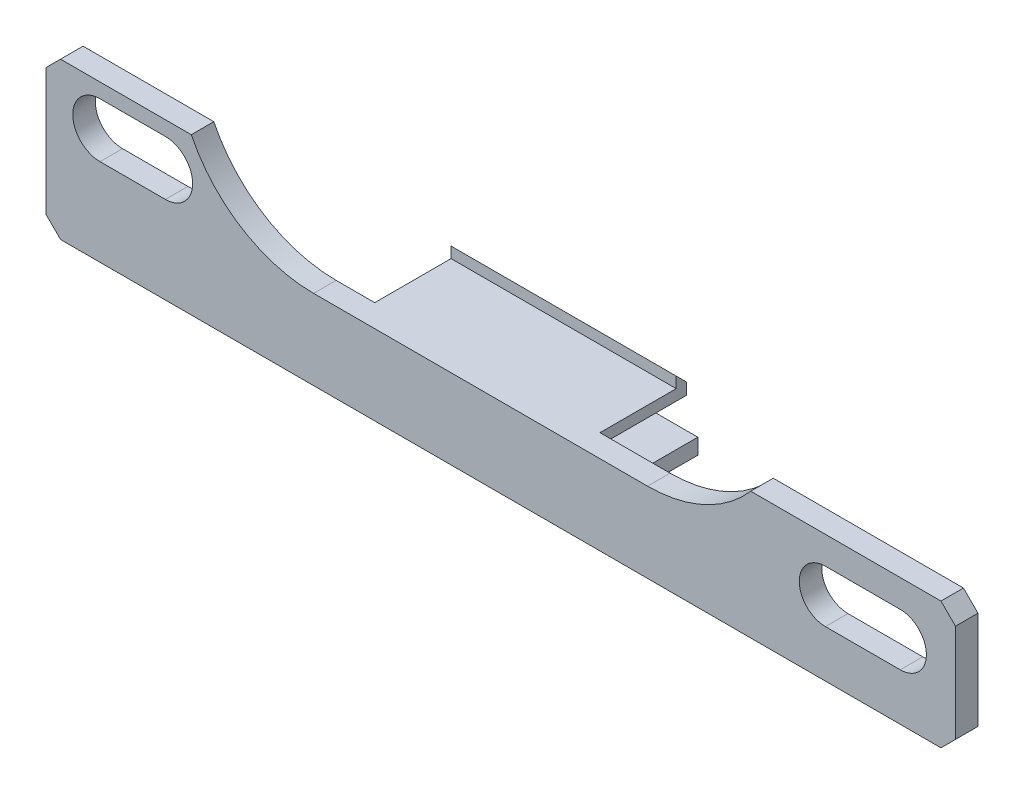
from build123d import *

# Parameters (mm, degrees)
BOSS_EXTRUDE1_DEPTH = 1.5748
SKETCH2_W           = 17.272
SKETCH2_H           = 1.0922
BOSS_EXTRUDE2_DEPTH = 7.62
BOSS_EXTRUDE3_START = -21.4122
BOSS_EXTRUDE3_DEPTH = 15.748
CHAMFER1_SIZE       = 1.016


with BuildPart() as part:
    # Sketch1 → Boss-Extrude1 (new body)
    with BuildSketch(Plane.XY):
        with BuildLine():
            Line((0, 0), (0, 10.922))
            Line((0, 10.922), (10.16, 10.922))
            ThreePointArc((10.16, 10.922), (13.673272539, 7.030769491), (18.713428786, 5.588))
            Line((18.713428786, 5.588), (42.06490466, 5.588))
            ThreePointArc((42.06490466, 5.588), (46.030478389, 6.452754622), (49.276, 8.89))
            Line((49.276, 8.89), (63.595327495, 8.89))
            Line((63.595327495, 8.89), (63.595327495, 0))
            Line((63.595327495, 0), (0, 0))
        make_face()
        with BuildLine():
            Line((3.776028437, 9.906), (8.348028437, 9.906))
            ThreePointArc((8.348028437, 9.906), (10.253028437, 8.001), (8.348028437, 6.096))
            Line((8.348028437, 6.096), (3.776028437, 6.096))
            ThreePointArc((3.776028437, 6.096), (1.871028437, 8.001), (3.776028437, 9.906))
        make_face(mode=Mode.SUBTRACT)
        with BuildLine():
            Line((54.499828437, 6.9596), (59.732228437, 6.9596))
            ThreePointArc((59.732228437, 6.9596), (61.561028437, 5.1308), (59.732228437, 3.302))
            Line((59.732228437, 3.302), (54.499828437, 3.302))
            ThreePointArc((54.499828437, 3.302), (52.671028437, 5.1308), (54.499828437, 6.9596))
        make_face(mode=Mode.SUBTRACT)
    extrude(amount=-BOSS_EXTRUDE1_DEPTH)

    # Sketch2 → Boss-Extrude2 (add)
    with BuildSketch(Plane.XY):
        with Locations((29.323107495, 2.1463)):
            Rectangle(SKETCH2_W, SKETCH2_H)
    extrude(amount=-BOSS_EXTRUDE2_DEPTH)

    # Sketch3 → Boss-Extrude3 (add)
    with BuildSketch(Plane.ZY.offset(BOSS_EXTRUDE3_START)):
        Polygon((-1.5748, 4.826), (-7.62, 4.826), (-7.62, 5.6388), (-6.9088, 6.35), (-6.9088, 5.588), (-1.5748, 5.588), align=None)
    extrude(amount=-BOSS_EXTRUDE3_DEPTH)

    # Chamfer1
    chamfer1_edges = [part.edges().sort_by_distance(p)[0] for p in [
        (0, 0, -0.7874),
        (0, 10.922, -0.7874),
        (63.595327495, 8.89, -0.7874),
        (63.595327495, 0, -0.7874),
    ]]
    chamfer(chamfer1_edges, length=CHAMFER1_SIZE)


solid = part.part
